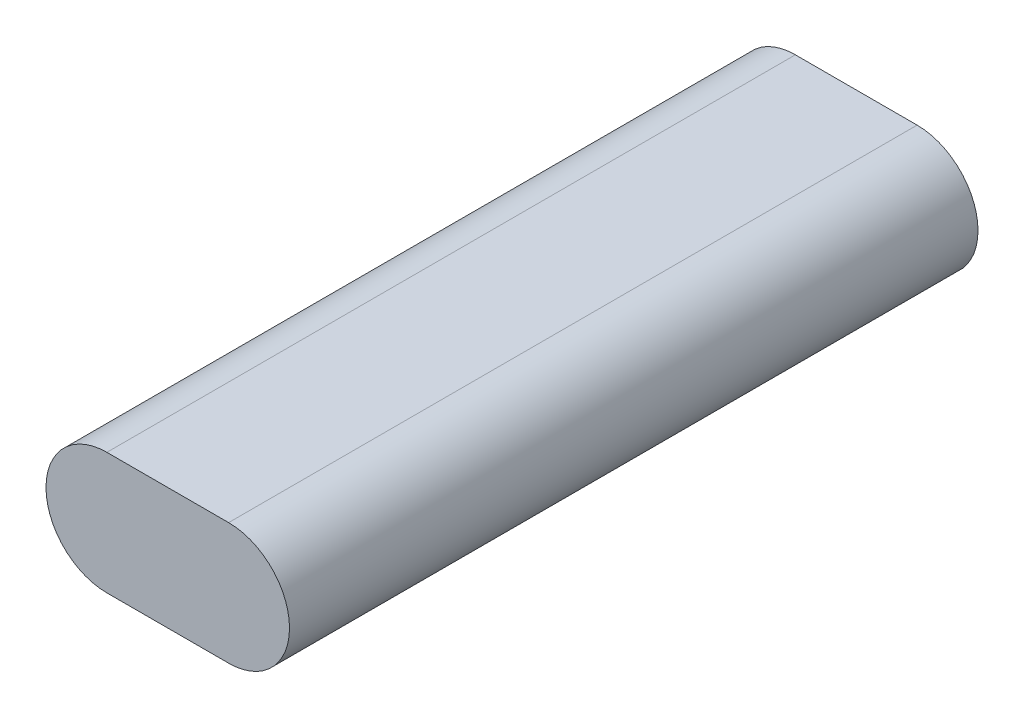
from build123d import *

# Parameters (mm, degrees)
EXTRUDE1_DEPTH = 130.175


with BuildPart() as part:
    # Sketch1 → Extrude1 (new body)
    with BuildSketch(Plane.XY):
        with BuildLine():
            Line((0, 11.509375), (23.01875, 11.509375))
            ThreePointArc((23.01875, 11.509375), (34.528125, 0), (23.01875, -11.509375))
            Line((23.01875, -11.509375), (0, -11.509375))
            ThreePointArc((0, -11.509375), (-11.509375, 0), (0, 11.509375))
        make_face()
    extrude(amount=EXTRUDE1_DEPTH)


solid = part.part
